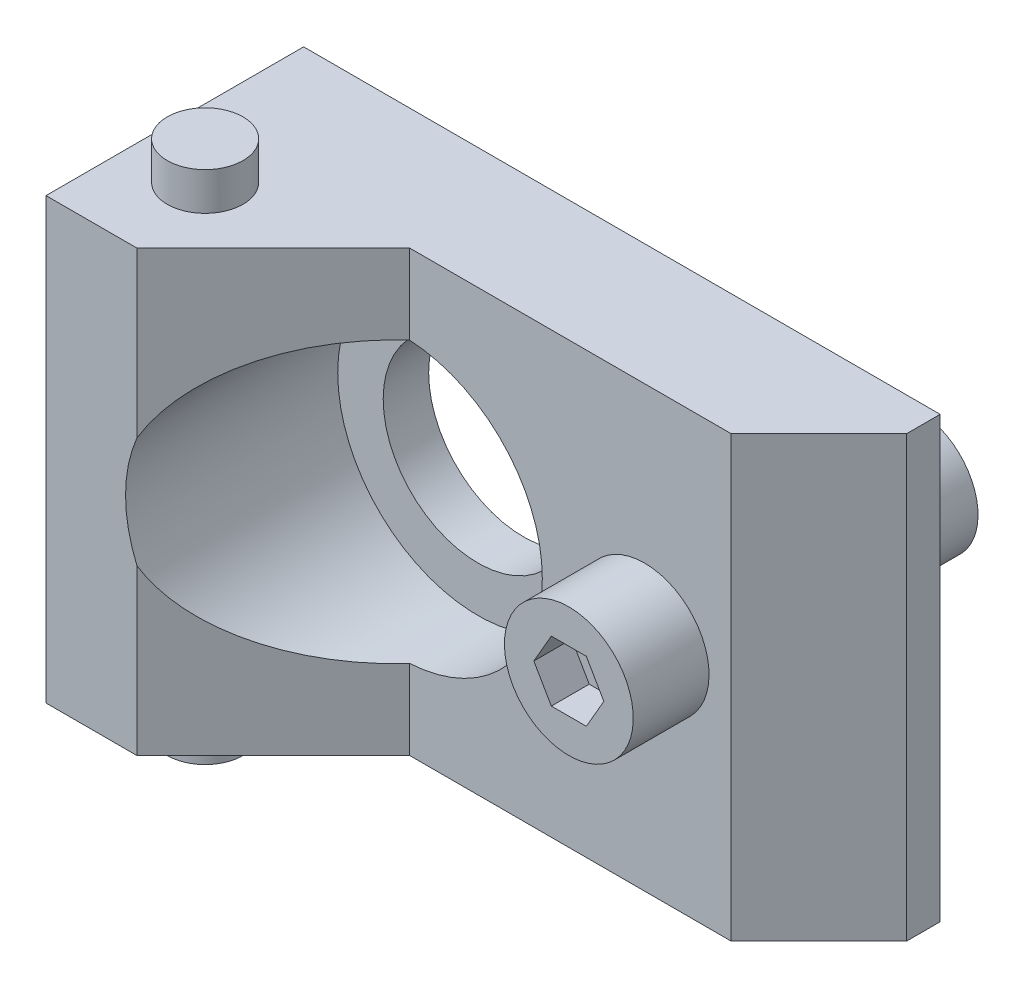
ISO-10303-21;
HEADER;
FILE_DESCRIPTION(('STEP AP214'),'2;1');
FILE_NAME('part.step','',(''),(''),'','','');
FILE_SCHEMA(('AUTOMOTIVE_DESIGN { 1 0 10303 214 1 1 1 1 }'));
ENDSEC;
DATA;
#1=APPLICATION_CONTEXT('core data for automotive mechanical design processes');
#2=APPLICATION_PROTOCOL_DEFINITION('international standard','automotive_design',2000,#1);
#3=PRODUCT_CONTEXT('',#1,'mechanical');
#4=PRODUCT('Part','Part','',(#3));
#5=PRODUCT_RELATED_PRODUCT_CATEGORY('part','',(#4));
#6=PRODUCT_DEFINITION_FORMATION('','',#4);
#7=PRODUCT_DEFINITION_CONTEXT('part definition',#1,'design');
#8=PRODUCT_DEFINITION('design','',#6,#7);
#9=PRODUCT_DEFINITION_SHAPE('','',#8);
#10=(LENGTH_UNIT() NAMED_UNIT(*) SI_UNIT(.MILLI.,.METRE.));
#11=(NAMED_UNIT(*) PLANE_ANGLE_UNIT() SI_UNIT($,.RADIAN.));
#12=(NAMED_UNIT(*) SI_UNIT($,.STERADIAN.) SOLID_ANGLE_UNIT());
#13=UNCERTAINTY_MEASURE_WITH_UNIT(LENGTH_MEASURE(1.E-05),#10,'distance_accuracy_value','');
#14=(GEOMETRIC_REPRESENTATION_CONTEXT(3) GLOBAL_UNCERTAINTY_ASSIGNED_CONTEXT((#13)) GLOBAL_UNIT_ASSIGNED_CONTEXT((#10,
#11,#12)) REPRESENTATION_CONTEXT('',''));
#15=CARTESIAN_POINT('',(0.,0.,0.));
#16=DIRECTION('',(0.,0.,1.));
#17=DIRECTION('',(1.,0.,0.));
#18=AXIS2_PLACEMENT_3D('',#15,#16,#17);
#19=CARTESIAN_POINT('',(-26.,-17.,11.));
#20=DIRECTION('',(0.,1.,0.));
#21=DIRECTION('',(1.,0.,0.));
#22=AXIS2_PLACEMENT_3D('',#19,#20,#21);
#23=CYLINDRICAL_SURFACE('',#22,2.5);
#24=CARTESIAN_POINT('',(-26.,-17.,11.));
#25=DIRECTION('',(0.,-1.,0.));
#26=DIRECTION('',(-1.,0.,0.));
#27=AXIS2_PLACEMENT_3D('',#24,#25,#26);
#28=CIRCLE('',#27,2.5);
#29=CARTESIAN_POINT('',(-28.5,-17.,11.));
#30=VERTEX_POINT('',#29);
#31=EDGE_CURVE('E21',#30,#30,#28,.T.);
#32=ORIENTED_EDGE('',*,*,#31,.F.);
#33=EDGE_LOOP('',(#32));
#34=FACE_BOUND('',#33,.T.);
#35=CARTESIAN_POINT('',(-26.,-14.5,11.));
#36=DIRECTION('',(0.,1.,0.));
#37=DIRECTION('',(-1.,0.,0.));
#38=AXIS2_PLACEMENT_3D('',#35,#36,#37);
#39=CIRCLE('',#38,2.5);
#40=CARTESIAN_POINT('',(-28.5,-14.5,11.));
#41=VERTEX_POINT('',#40);
#42=EDGE_CURVE('E9',#41,#41,#39,.T.);
#43=ORIENTED_EDGE('',*,*,#42,.F.);
#44=EDGE_LOOP('',(#43));
#45=FACE_BOUND('',#44,.T.);
#46=ADVANCED_FACE('F14',(#34,#45),#23,.T.);
#47=CARTESIAN_POINT('',(-26.,-17.,11.));
#48=DIRECTION('',(0.,-1.,0.));
#49=DIRECTION('',(-1.,0.,0.));
#50=AXIS2_PLACEMENT_3D('',#47,#48,#49);
#51=PLANE('',#50);
#52=ORIENTED_EDGE('',*,*,#31,.T.);
#53=EDGE_LOOP('',(#52));
#54=FACE_BOUND('',#53,.T.);
#55=ADVANCED_FACE('F229',(#54),#51,.T.);
#56=CARTESIAN_POINT('',(-3.46410161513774,-2.,10.5));
#57=DIRECTION('',(0.,0.,-1.));
#58=DIRECTION('',(0.,-1.,0.));
#59=AXIS2_PLACEMENT_3D('',#56,#57,#58);
#60=PLANE('',#59);
#61=DIRECTION('',(0.5,0.86602540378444,0.));
#62=VECTOR('',#61,1.);
#63=CARTESIAN_POINT('',(-2.3094010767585,0.,10.5));
#64=LINE('',#63,#62);
#65=CARTESIAN_POINT('',(-2.3094010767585,0.,10.5));
#66=VERTEX_POINT('',#65);
#67=CARTESIAN_POINT('',(-1.15470053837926,2.,10.5));
#68=VERTEX_POINT('',#67);
#69=EDGE_CURVE('E174',#66,#68,#64,.T.);
#70=ORIENTED_EDGE('',*,*,#69,.F.);
#71=DIRECTION('',(0.5,-0.86602540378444,0.));
#72=VECTOR('',#71,1.);
#73=CARTESIAN_POINT('',(-2.3094010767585,0.,10.5));
#74=LINE('',#73,#72);
#75=CARTESIAN_POINT('',(-1.15470053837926,-2.,10.5));
#76=VERTEX_POINT('',#75);
#77=EDGE_CURVE('E188',#66,#76,#74,.T.);
#78=ORIENTED_EDGE('',*,*,#77,.T.);
#79=DIRECTION('',(1.,0.,0.));
#80=VECTOR('',#79,1.);
#81=CARTESIAN_POINT('',(-1.15470053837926,-2.,10.5));
#82=LINE('',#81,#80);
#83=CARTESIAN_POINT('',(1.15470053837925,-2.,10.5));
#84=VERTEX_POINT('',#83);
#85=EDGE_CURVE('E191',#76,#84,#82,.T.);
#86=ORIENTED_EDGE('',*,*,#85,.T.);
#87=DIRECTION('',(-0.5,-0.86602540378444,0.));
#88=VECTOR('',#87,1.);
#89=CARTESIAN_POINT('',(2.3094010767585,0.,10.5));
#90=LINE('',#89,#88);
#91=CARTESIAN_POINT('',(2.3094010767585,0.,10.5));
#92=VERTEX_POINT('',#91);
#93=EDGE_CURVE('E194',#92,#84,#90,.T.);
#94=ORIENTED_EDGE('',*,*,#93,.F.);
#95=DIRECTION('',(-0.5,0.86602540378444,0.));
#96=VECTOR('',#95,1.);
#97=CARTESIAN_POINT('',(2.3094010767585,0.,10.5));
#98=LINE('',#97,#96);
#99=CARTESIAN_POINT('',(1.15470053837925,2.,10.5));
#100=VERTEX_POINT('',#99);
#101=EDGE_CURVE('E197',#92,#100,#98,.T.);
#102=ORIENTED_EDGE('',*,*,#101,.T.);
#103=DIRECTION('',(-1.,0.,0.));
#104=VECTOR('',#103,1.);
#105=CARTESIAN_POINT('',(1.15470053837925,2.,10.5));
#106=LINE('',#105,#104);
#107=EDGE_CURVE('E200',#100,#68,#106,.T.);
#108=ORIENTED_EDGE('',*,*,#107,.T.);
#109=EDGE_LOOP('',(#70,#78,#86,#94,#102,#108));
#110=FACE_BOUND('',#109,.T.);
#111=ADVANCED_FACE('F251',(#110),#60,.F.);
#112=CARTESIAN_POINT('',(-26.,17.,11.));
#113=DIRECTION('',(0.,1.,0.));
#114=DIRECTION('',(-1.,0.,0.));
#115=AXIS2_PLACEMENT_3D('',#112,#113,#114);
#116=PLANE('',#115);
#117=CARTESIAN_POINT('',(-26.,17.,11.));
#118=DIRECTION('',(0.,1.,0.));
#119=DIRECTION('',(-1.,0.,0.));
#120=AXIS2_PLACEMENT_3D('',#117,#118,#119);
#121=CIRCLE('',#120,2.5);
#122=CARTESIAN_POINT('',(-28.5,17.,11.));
#123=VERTEX_POINT('',#122);
#124=EDGE_CURVE('E221',#123,#123,#121,.T.);
#125=ORIENTED_EDGE('',*,*,#124,.T.);
#126=EDGE_LOOP('',(#125));
#127=FACE_BOUND('',#126,.T.);
#128=ADVANCED_FACE('F253',(#127),#116,.T.);
#129=CARTESIAN_POINT('',(-1.15470053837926,-2.,10.5));
#130=DIRECTION('',(0.,-1.,0.));
#131=DIRECTION('',(1.,0.,0.));
#132=AXIS2_PLACEMENT_3D('',#129,#130,#131);
#133=PLANE('',#132);
#134=DIRECTION('',(0.,0.,1.));
#135=VECTOR('',#134,1.);
#136=CARTESIAN_POINT('',(-1.15470053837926,-2.,10.5));
#137=LINE('',#136,#135);
#138=CARTESIAN_POINT('',(-1.15470053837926,-2.,13.));
#139=VERTEX_POINT('',#138);
#140=EDGE_CURVE('E205',#76,#139,#137,.T.);
#141=ORIENTED_EDGE('',*,*,#140,.T.);
#142=DIRECTION('',(1.,0.,0.));
#143=VECTOR('',#142,1.);
#144=CARTESIAN_POINT('',(-1.15470053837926,-2.,13.));
#145=LINE('',#144,#143);
#146=CARTESIAN_POINT('',(1.15470053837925,-2.,13.));
#147=VERTEX_POINT('',#146);
#148=EDGE_CURVE('E175',#139,#147,#145,.T.);
#149=ORIENTED_EDGE('',*,*,#148,.T.);
#150=DIRECTION('',(0.,0.,1.));
#151=VECTOR('',#150,1.);
#152=CARTESIAN_POINT('',(1.15470053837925,-2.,10.5));
#153=LINE('',#152,#151);
#154=EDGE_CURVE('E207',#84,#147,#153,.T.);
#155=ORIENTED_EDGE('',*,*,#154,.F.);
#156=ORIENTED_EDGE('',*,*,#85,.F.);
#157=EDGE_LOOP('',(#141,#149,#155,#156));
#158=FACE_BOUND('',#157,.T.);
#159=ADVANCED_FACE('F261',(#158),#133,.F.);
#160=CARTESIAN_POINT('',(2.3094010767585,0.,10.5));
#161=DIRECTION('',(-0.86602540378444,0.5,0.));
#162=DIRECTION('',(-0.5,-0.86602540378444,0.));
#163=AXIS2_PLACEMENT_3D('',#160,#161,#162);
#164=PLANE('',#163);
#165=ORIENTED_EDGE('',*,*,#154,.T.);
#166=DIRECTION('',(-0.5,-0.86602540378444,0.));
#167=VECTOR('',#166,1.);
#168=CARTESIAN_POINT('',(2.3094010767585,0.,13.));
#169=LINE('',#168,#167);
#170=CARTESIAN_POINT('',(2.3094010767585,0.,13.));
#171=VERTEX_POINT('',#170);
#172=EDGE_CURVE('E178',#171,#147,#169,.T.);
#173=ORIENTED_EDGE('',*,*,#172,.F.);
#174=DIRECTION('',(0.,0.,1.));
#175=VECTOR('',#174,1.);
#176=CARTESIAN_POINT('',(2.3094010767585,0.,10.5));
#177=LINE('',#176,#175);
#178=EDGE_CURVE('E209',#92,#171,#177,.T.);
#179=ORIENTED_EDGE('',*,*,#178,.F.);
#180=ORIENTED_EDGE('',*,*,#93,.T.);
#181=EDGE_LOOP('',(#165,#173,#179,#180));
#182=FACE_BOUND('',#181,.T.);
#183=ADVANCED_FACE('F279',(#182),#164,.T.);
#184=CARTESIAN_POINT('',(2.3094010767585,0.,10.5));
#185=DIRECTION('',(0.86602540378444,0.5,0.));
#186=DIRECTION('',(-0.5,0.86602540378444,0.));
#187=AXIS2_PLACEMENT_3D('',#184,#185,#186);
#188=PLANE('',#187);
#189=ORIENTED_EDGE('',*,*,#178,.T.);
#190=DIRECTION('',(-0.5,0.86602540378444,0.));
#191=VECTOR('',#190,1.);
#192=CARTESIAN_POINT('',(2.3094010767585,0.,13.));
#193=LINE('',#192,#191);
#194=CARTESIAN_POINT('',(1.15470053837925,2.,13.));
#195=VERTEX_POINT('',#194);
#196=EDGE_CURVE('E181',#171,#195,#193,.T.);
#197=ORIENTED_EDGE('',*,*,#196,.T.);
#198=DIRECTION('',(0.,0.,1.));
#199=VECTOR('',#198,1.);
#200=CARTESIAN_POINT('',(1.15470053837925,2.,10.5));
#201=LINE('',#200,#199);
#202=EDGE_CURVE('E211',#100,#195,#201,.T.);
#203=ORIENTED_EDGE('',*,*,#202,.F.);
#204=ORIENTED_EDGE('',*,*,#101,.F.);
#205=EDGE_LOOP('',(#189,#197,#203,#204));
#206=FACE_BOUND('',#205,.T.);
#207=ADVANCED_FACE('F283',(#206),#188,.F.);
#208=CARTESIAN_POINT('',(1.15470053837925,2.,10.5));
#209=DIRECTION('',(0.,1.,0.));
#210=DIRECTION('',(0.,0.,-1.));
#211=AXIS2_PLACEMENT_3D('',#208,#209,#210);
#212=PLANE('',#211);
#213=ORIENTED_EDGE('',*,*,#202,.T.);
#214=DIRECTION('',(-1.,0.,0.));
#215=VECTOR('',#214,1.);
#216=CARTESIAN_POINT('',(1.15470053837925,2.,13.));
#217=LINE('',#216,#215);
#218=CARTESIAN_POINT('',(-1.15470053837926,2.,13.));
#219=VERTEX_POINT('',#218);
#220=EDGE_CURVE('E184',#195,#219,#217,.T.);
#221=ORIENTED_EDGE('',*,*,#220,.T.);
#222=DIRECTION('',(0.,0.,1.));
#223=VECTOR('',#222,1.);
#224=CARTESIAN_POINT('',(-1.15470053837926,2.,10.5));
#225=LINE('',#224,#223);
#226=EDGE_CURVE('E213',#68,#219,#225,.T.);
#227=ORIENTED_EDGE('',*,*,#226,.F.);
#228=ORIENTED_EDGE('',*,*,#107,.F.);
#229=EDGE_LOOP('',(#213,#221,#227,#228));
#230=FACE_BOUND('',#229,.T.);
#231=ADVANCED_FACE('F272',(#230),#212,.F.);
#232=CARTESIAN_POINT('',(-2.3094010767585,0.,10.5));
#233=DIRECTION('',(0.86602540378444,-0.5,0.));
#234=DIRECTION('',(0.5,0.86602540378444,0.));
#235=AXIS2_PLACEMENT_3D('',#232,#233,#234);
#236=PLANE('',#235);
#237=ORIENTED_EDGE('',*,*,#226,.T.);
#238=DIRECTION('',(0.5,0.86602540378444,0.));
#239=VECTOR('',#238,1.);
#240=CARTESIAN_POINT('',(-2.3094010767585,0.,13.));
#241=LINE('',#240,#239);
#242=CARTESIAN_POINT('',(-2.3094010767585,0.,13.));
#243=VERTEX_POINT('',#242);
#244=EDGE_CURVE('E28',#243,#219,#241,.T.);
#245=ORIENTED_EDGE('',*,*,#244,.F.);
#246=DIRECTION('',(0.,0.,1.));
#247=VECTOR('',#246,1.);
#248=CARTESIAN_POINT('',(-2.3094010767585,0.,10.5));
#249=LINE('',#248,#247);
#250=EDGE_CURVE('E32',#66,#243,#249,.T.);
#251=ORIENTED_EDGE('',*,*,#250,.F.);
#252=ORIENTED_EDGE('',*,*,#69,.T.);
#253=EDGE_LOOP('',(#237,#245,#251,#252));
#254=FACE_BOUND('',#253,.T.);
#255=ADVANCED_FACE('F268',(#254),#236,.T.);
#256=CARTESIAN_POINT('',(-2.3094010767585,0.,10.5));
#257=DIRECTION('',(-0.86602540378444,-0.5,0.));
#258=DIRECTION('',(0.5,-0.86602540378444,0.));
#259=AXIS2_PLACEMENT_3D('',#256,#257,#258);
#260=PLANE('',#259);
#261=ORIENTED_EDGE('',*,*,#77,.F.);
#262=ORIENTED_EDGE('',*,*,#250,.T.);
#263=DIRECTION('',(0.5,-0.86602540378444,0.));
#264=VECTOR('',#263,1.);
#265=CARTESIAN_POINT('',(-2.3094010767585,0.,13.));
#266=LINE('',#265,#264);
#267=EDGE_CURVE('E171',#243,#139,#266,.T.);
#268=ORIENTED_EDGE('',*,*,#267,.T.);
#269=ORIENTED_EDGE('',*,*,#140,.F.);
#270=EDGE_LOOP('',(#261,#262,#268,#269));
#271=FACE_BOUND('',#270,.T.);
#272=ADVANCED_FACE('F271',(#271),#260,.F.);
#273=CARTESIAN_POINT('',(0.,0.,-10.));
#274=DIRECTION('',(0.,0.,-1.));
#275=DIRECTION('',(0.898965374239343,0.438019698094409,0.));
#276=AXIS2_PLACEMENT_3D('',#273,#274,#275);
#277=PLANE('',#276);
#278=CARTESIAN_POINT('',(0.,0.,-10.));
#279=DIRECTION('',(0.,0.,-1.));
#280=DIRECTION('',(0.898965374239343,0.438019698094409,0.));
#281=AXIS2_PLACEMENT_3D('',#278,#279,#280);
#282=CIRCLE('',#281,4.);
#283=CARTESIAN_POINT('',(3.59586149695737,1.75207879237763,-10.));
#284=VERTEX_POINT('',#283);
#285=EDGE_CURVE('E165',#284,#284,#282,.T.);
#286=ORIENTED_EDGE('',*,*,#285,.T.);
#287=EDGE_LOOP('',(#286));
#288=FACE_BOUND('',#287,.T.);
#289=ADVANCED_FACE('F275',(#288),#277,.T.);
#290=CARTESIAN_POINT('',(-16.,0.,3.));
#291=DIRECTION('',(0.,0.,1.));
#292=DIRECTION('',(-1.,0.,0.));
#293=AXIS2_PLACEMENT_3D('',#290,#291,#292);
#294=PLANE('',#293);
#295=CARTESIAN_POINT('',(-16.,0.,3.));
#296=DIRECTION('',(0.,0.,1.));
#297=DIRECTION('',(-1.,0.,0.));
#298=AXIS2_PLACEMENT_3D('',#295,#296,#297);
#299=CIRCLE('',#298,9.25);
#300=CARTESIAN_POINT('',(-25.25,0.,3.));
#301=VERTEX_POINT('',#300);
#302=EDGE_CURVE('E160',#301,#301,#299,.T.);
#303=ORIENTED_EDGE('',*,*,#302,.T.);
#304=EDGE_LOOP('',(#303));
#305=FACE_BOUND('',#304,.T.);
#306=CARTESIAN_POINT('',(-16.,0.,3.));
#307=DIRECTION('',(0.,0.,1.));
#308=DIRECTION('',(-1.,0.,0.));
#309=AXIS2_PLACEMENT_3D('',#306,#307,#308);
#310=CIRCLE('',#309,6.25);
#311=CARTESIAN_POINT('',(-22.25,0.,3.));
#312=VERTEX_POINT('',#311);
#313=EDGE_CURVE('E157',#312,#312,#310,.F.);
#314=ORIENTED_EDGE('',*,*,#313,.T.);
#315=EDGE_LOOP('',(#314));
#316=FACE_BOUND('',#315,.T.);
#317=ADVANCED_FACE('F301',(#305,#316),#294,.T.);
#318=CARTESIAN_POINT('',(-26.,17.,11.));
#319=DIRECTION('',(0.,-1.,0.));
#320=DIRECTION('',(1.,0.,0.));
#321=AXIS2_PLACEMENT_3D('',#318,#319,#320);
#322=CYLINDRICAL_SURFACE('',#321,2.5);
#323=ORIENTED_EDGE('',*,*,#124,.F.);
#324=EDGE_LOOP('',(#323));
#325=FACE_BOUND('',#324,.T.);
#326=CARTESIAN_POINT('',(-26.,14.5,11.));
#327=DIRECTION('',(0.,-1.,0.));
#328=DIRECTION('',(0.,0.,-1.));
#329=AXIS2_PLACEMENT_3D('',#326,#327,#328);
#330=CIRCLE('',#329,2.5);
#331=CARTESIAN_POINT('',(-26.,14.5,8.5));
#332=VERTEX_POINT('',#331);
#333=EDGE_CURVE('E224',#332,#332,#330,.T.);
#334=ORIENTED_EDGE('',*,*,#333,.F.);
#335=EDGE_LOOP('',(#334));
#336=FACE_BOUND('',#335,.T.);
#337=ADVANCED_FACE('F297',(#325,#336),#322,.T.);
#338=CARTESIAN_POINT('',(0.,0.,13.));
#339=DIRECTION('',(0.,0.,1.));
#340=DIRECTION('',(0.,1.,0.));
#341=AXIS2_PLACEMENT_3D('',#338,#339,#340);
#342=PLANE('',#341);
#343=CARTESIAN_POINT('',(0.,0.,13.));
#344=DIRECTION('',(0.,0.,1.));
#345=DIRECTION('',(0.,1.,0.));
#346=AXIS2_PLACEMENT_3D('',#343,#344,#345);
#347=CIRCLE('',#346,4.25);
#348=CARTESIAN_POINT('',(0.,4.25,13.));
#349=VERTEX_POINT('',#348);
#350=EDGE_CURVE('E218',#349,#349,#347,.T.);
#351=ORIENTED_EDGE('',*,*,#350,.T.);
#352=EDGE_LOOP('',(#351));
#353=FACE_BOUND('',#352,.T.);
#354=ORIENTED_EDGE('',*,*,#267,.F.);
#355=ORIENTED_EDGE('',*,*,#244,.T.);
#356=ORIENTED_EDGE('',*,*,#220,.F.);
#357=ORIENTED_EDGE('',*,*,#196,.F.);
#358=ORIENTED_EDGE('',*,*,#172,.T.);
#359=ORIENTED_EDGE('',*,*,#148,.F.);
#360=EDGE_LOOP('',(#354,#355,#356,#357,#358,#359));
#361=FACE_BOUND('',#360,.T.);
#362=ADVANCED_FACE('F295',(#353,#361),#342,.T.);
#363=CARTESIAN_POINT('',(0.,0.,-10.));
#364=DIRECTION('',(0.,0.,1.));
#365=DIRECTION('',(-0.898965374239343,-0.438019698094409,0.));
#366=AXIS2_PLACEMENT_3D('',#363,#364,#365);
#367=CYLINDRICAL_SURFACE('',#366,4.);
#368=ORIENTED_EDGE('',*,*,#285,.F.);
#369=EDGE_LOOP('',(#368));
#370=FACE_BOUND('',#369,.T.);
#371=CARTESIAN_POINT('',(0.,0.,0.));
#372=DIRECTION('',(0.,0.,1.));
#373=DIRECTION('',(0.,-1.,0.));
#374=AXIS2_PLACEMENT_3D('',#371,#372,#373);
#375=CIRCLE('',#374,4.);
#376=CARTESIAN_POINT('',(0.,-4.,0.));
#377=VERTEX_POINT('',#376);
#378=EDGE_CURVE('E168',#377,#377,#375,.T.);
#379=ORIENTED_EDGE('',*,*,#378,.F.);
#380=EDGE_LOOP('',(#379));
#381=FACE_BOUND('',#380,.T.);
#382=ADVANCED_FACE('F266',(#370,#381),#367,.T.);
#383=CARTESIAN_POINT('',(-16.,0.,17.));
#384=DIRECTION('',(0.,0.,1.));
#385=DIRECTION('',(-1.,0.,0.));
#386=AXIS2_PLACEMENT_3D('',#383,#384,#385);
#387=CYLINDRICAL_SURFACE('',#386,6.25);
#388=CARTESIAN_POINT('',(-16.,0.,0.));
#389=DIRECTION('',(0.,0.,1.));
#390=DIRECTION('',(-1.,0.,0.));
#391=AXIS2_PLACEMENT_3D('',#388,#389,#390);
#392=CIRCLE('',#391,6.25);
#393=CARTESIAN_POINT('',(-22.25,0.,0.));
#394=VERTEX_POINT('',#393);
#395=EDGE_CURVE('E159',#394,#394,#392,.T.);
#396=ORIENTED_EDGE('',*,*,#395,.F.);
#397=EDGE_LOOP('',(#396));
#398=FACE_BOUND('',#397,.T.);
#399=ORIENTED_EDGE('',*,*,#313,.F.);
#400=EDGE_LOOP('',(#399));
#401=FACE_BOUND('',#400,.T.);
#402=ADVANCED_FACE('F335',(#398,#401),#387,.F.);
#403=CARTESIAN_POINT('',(-16.,0.,3.));
#404=DIRECTION('',(0.,0.,1.));
#405=DIRECTION('',(-1.,0.,0.));
#406=AXIS2_PLACEMENT_3D('',#403,#404,#405);
#407=CYLINDRICAL_SURFACE('',#406,9.25);
#408=CARTESIAN_POINT('',(-16.,0.,17.));
#409=DIRECTION('',(0.,0.,1.));
#410=DIRECTION('',(-1.,0.,0.));
#411=AXIS2_PLACEMENT_3D('',#408,#409,#410);
#412=CIRCLE('',#411,9.25);
#413=CARTESIAN_POINT('',(-24.5,3.64862987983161,17.));
#414=VERTEX_POINT('',#413);
#415=CARTESIAN_POINT('',(-24.5,-3.6486298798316,17.));
#416=VERTEX_POINT('',#415);
#417=EDGE_CURVE('E364',#414,#416,#412,.T.);
#418=ORIENTED_EDGE('',*,*,#417,.T.);
#419=CARTESIAN_POINT('',(-16.,0.,8.5));
#420=DIRECTION('',(-0.707106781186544,0.,-0.707106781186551));
#421=DIRECTION('',(-0.707106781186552,0.,0.707106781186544));
#422=AXIS2_PLACEMENT_3D('',#419,#420,#421);
#423=ELLIPSE('',#422,13.0814754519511,9.25);
#424=CARTESIAN_POINT('',(-15.5,-9.23647660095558,8.));
#425=VERTEX_POINT('',#424);
#426=EDGE_CURVE('E164',#416,#425,#423,.F.);
#427=ORIENTED_EDGE('',*,*,#426,.T.);
#428=CARTESIAN_POINT('',(-16.,0.,8.));
#429=DIRECTION('',(0.,0.,-1.));
#430=DIRECTION('',(1.,0.,0.));
#431=AXIS2_PLACEMENT_3D('',#428,#429,#430);
#432=CIRCLE('',#431,9.25);
#433=CARTESIAN_POINT('',(-15.5,9.23647660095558,8.));
#434=VERTEX_POINT('',#433);
#435=EDGE_CURVE('E146',#425,#434,#432,.F.);
#436=ORIENTED_EDGE('',*,*,#435,.T.);
#437=EDGE_CURVE('E150',#434,#414,#423,.F.);
#438=ORIENTED_EDGE('',*,*,#437,.T.);
#439=EDGE_LOOP('',(#418,#427,#436,#438));
#440=FACE_BOUND('',#439,.T.);
#441=ORIENTED_EDGE('',*,*,#302,.F.);
#442=EDGE_LOOP('',(#441));
#443=FACE_BOUND('',#442,.T.);
#444=ADVANCED_FACE('F319',(#440,#443),#407,.F.);
#445=CARTESIAN_POINT('',(-24.5,-14.5,17.));
#446=DIRECTION('',(-0.707106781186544,0.,-0.707106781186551));
#447=DIRECTION('',(0.707106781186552,0.,-0.707106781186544));
#448=AXIS2_PLACEMENT_3D('',#445,#446,#447);
#449=PLANE('',#448);
#450=DIRECTION('',(0.,1.,0.));
#451=VECTOR('',#450,1.);
#452=CARTESIAN_POINT('',(-15.5,-14.5,8.));
#453=LINE('',#452,#451);
#454=CARTESIAN_POINT('',(-15.5,14.5,8.));
#455=VERTEX_POINT('',#454);
#456=EDGE_CURVE('E404',#434,#455,#453,.T.);
#457=ORIENTED_EDGE('',*,*,#456,.T.);
#458=DIRECTION('',(-0.707106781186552,0.,0.707106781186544));
#459=VECTOR('',#458,1.);
#460=CARTESIAN_POINT('',(-24.5,14.5,17.));
#461=LINE('',#460,#459);
#462=CARTESIAN_POINT('',(-24.5,14.5,17.));
#463=VERTEX_POINT('',#462);
#464=EDGE_CURVE('E369',#455,#463,#461,.T.);
#465=ORIENTED_EDGE('',*,*,#464,.T.);
#466=DIRECTION('',(0.,1.,0.));
#467=VECTOR('',#466,1.);
#468=CARTESIAN_POINT('',(-24.5,-14.5,17.));
#469=LINE('',#468,#467);
#470=EDGE_CURVE('E359',#414,#463,#469,.T.);
#471=ORIENTED_EDGE('',*,*,#470,.F.);
#472=ORIENTED_EDGE('',*,*,#437,.F.);
#473=EDGE_LOOP('',(#457,#465,#471,#472));
#474=FACE_BOUND('',#473,.T.);
#475=ADVANCED_FACE('F313',(#474),#449,.F.);
#476=CARTESIAN_POINT('',(11.5,14.5,17.));
#477=DIRECTION('',(0.,-1.,0.));
#478=DIRECTION('',(1.,0.,0.));
#479=AXIS2_PLACEMENT_3D('',#476,#477,#478);
#480=PLANE('',#479);
#481=DIRECTION('',(-1.,0.,0.));
#482=VECTOR('',#481,1.);
#483=CARTESIAN_POINT('',(11.5,14.5,17.));
#484=LINE('',#483,#482);
#485=CARTESIAN_POINT('',(-30.5,14.5,17.));
#486=VERTEX_POINT('',#485);
#487=EDGE_CURVE('E360',#463,#486,#484,.T.);
#488=ORIENTED_EDGE('',*,*,#487,.F.);
#489=ORIENTED_EDGE('',*,*,#464,.F.);
#490=DIRECTION('',(-1.,0.,0.));
#491=VECTOR('',#490,1.);
#492=CARTESIAN_POINT('',(5.71320343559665,14.5,8.));
#493=LINE('',#492,#491);
#494=CARTESIAN_POINT('',(5.71320343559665,14.5,8.));
#495=VERTEX_POINT('',#494);
#496=EDGE_CURVE('E140',#495,#455,#493,.T.);
#497=ORIENTED_EDGE('',*,*,#496,.F.);
#498=DIRECTION('',(-0.707106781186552,0.,0.707106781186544));
#499=VECTOR('',#498,1.);
#500=CARTESIAN_POINT('',(5.71320343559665,14.5,8.));
#501=LINE('',#500,#499);
#502=CARTESIAN_POINT('',(11.5,14.5,2.2132034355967));
#503=VERTEX_POINT('',#502);
#504=EDGE_CURVE('E122',#503,#495,#501,.T.);
#505=ORIENTED_EDGE('',*,*,#504,.F.);
#506=DIRECTION('',(0.,0.,-1.));
#507=VECTOR('',#506,1.);
#508=CARTESIAN_POINT('',(11.5,14.5,17.));
#509=LINE('',#508,#507);
#510=CARTESIAN_POINT('',(11.5,14.5,0.));
#511=VERTEX_POINT('',#510);
#512=EDGE_CURVE('E136',#503,#511,#509,.T.);
#513=ORIENTED_EDGE('',*,*,#512,.T.);
#514=DIRECTION('',(-1.,0.,0.));
#515=VECTOR('',#514,1.);
#516=CARTESIAN_POINT('',(11.5,14.5,0.));
#517=LINE('',#516,#515);
#518=CARTESIAN_POINT('',(-30.5,14.5,0.));
#519=VERTEX_POINT('',#518);
#520=EDGE_CURVE('E390',#511,#519,#517,.T.);
#521=ORIENTED_EDGE('',*,*,#520,.T.);
#522=DIRECTION('',(0.,0.,-1.));
#523=VECTOR('',#522,1.);
#524=CARTESIAN_POINT('',(-30.5,14.5,17.));
#525=LINE('',#524,#523);
#526=EDGE_CURVE('E147',#486,#519,#525,.T.);
#527=ORIENTED_EDGE('',*,*,#526,.F.);
#528=EDGE_LOOP('',(#488,#489,#497,#505,#513,#521,#527));
#529=FACE_BOUND('',#528,.T.);
#530=ORIENTED_EDGE('',*,*,#333,.T.);
#531=EDGE_LOOP('',(#530));
#532=FACE_BOUND('',#531,.T.);
#533=ADVANCED_FACE('F134',(#529,#532),#480,.F.);
#534=CARTESIAN_POINT('',(0.,0.,18.));
#535=DIRECTION('',(0.,0.,1.));
#536=DIRECTION('',(0.,1.,0.));
#537=AXIS2_PLACEMENT_3D('',#534,#535,#536);
#538=CYLINDRICAL_SURFACE('',#537,4.25);
#539=CARTESIAN_POINT('',(0.,0.,8.));
#540=DIRECTION('',(0.,0.,1.));
#541=DIRECTION('',(0.,1.,0.));
#542=AXIS2_PLACEMENT_3D('',#539,#540,#541);
#543=CIRCLE('',#542,4.25);
#544=CARTESIAN_POINT('',(0.,4.25,8.));
#545=VERTEX_POINT('',#544);
#546=EDGE_CURVE('E215',#545,#545,#543,.T.);
#547=ORIENTED_EDGE('',*,*,#546,.T.);
#548=EDGE_LOOP('',(#547));
#549=FACE_BOUND('',#548,.T.);
#550=ORIENTED_EDGE('',*,*,#350,.F.);
#551=EDGE_LOOP('',(#550));
#552=FACE_BOUND('',#551,.T.);
#553=ADVANCED_FACE('F291',(#549,#552),#538,.T.);
#554=CARTESIAN_POINT('',(5.71320343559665,-14.5,8.));
#555=DIRECTION('',(-0.707106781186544,0.,-0.707106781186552));
#556=DIRECTION('',(0.707106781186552,0.,-0.707106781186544));
#557=AXIS2_PLACEMENT_3D('',#554,#555,#556);
#558=PLANE('',#557);
#559=ORIENTED_EDGE('',*,*,#504,.T.);
#560=DIRECTION('',(0.,1.,0.));
#561=VECTOR('',#560,1.);
#562=CARTESIAN_POINT('',(5.71320343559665,-14.5,8.));
#563=LINE('',#562,#561);
#564=CARTESIAN_POINT('',(5.71320343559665,-14.5,8.));
#565=VERTEX_POINT('',#564);
#566=EDGE_CURVE('E129',#565,#495,#563,.T.);
#567=ORIENTED_EDGE('',*,*,#566,.F.);
#568=DIRECTION('',(-0.707106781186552,0.,0.707106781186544));
#569=VECTOR('',#568,1.);
#570=CARTESIAN_POINT('',(5.71320343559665,-14.5,8.));
#571=LINE('',#570,#569);
#572=CARTESIAN_POINT('',(11.5,-14.5,2.2132034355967));
#573=VERTEX_POINT('',#572);
#574=EDGE_CURVE('E125',#573,#565,#571,.T.);
#575=ORIENTED_EDGE('',*,*,#574,.F.);
#576=DIRECTION('',(0.,1.,0.));
#577=VECTOR('',#576,1.);
#578=CARTESIAN_POINT('',(11.5,-14.5,2.2132034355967));
#579=LINE('',#578,#577);
#580=EDGE_CURVE('E119',#573,#503,#579,.T.);
#581=ORIENTED_EDGE('',*,*,#580,.T.);
#582=EDGE_LOOP('',(#559,#567,#575,#581));
#583=FACE_BOUND('',#582,.T.);
#584=ADVANCED_FACE('F121',(#583),#558,.F.);
#585=CARTESIAN_POINT('',(11.5,-14.5,17.));
#586=DIRECTION('',(-1.,0.,0.));
#587=DIRECTION('',(0.,0.,-1.));
#588=AXIS2_PLACEMENT_3D('',#585,#586,#587);
#589=PLANE('',#588);
#590=ORIENTED_EDGE('',*,*,#512,.F.);
#591=ORIENTED_EDGE('',*,*,#580,.F.);
#592=DIRECTION('',(0.,0.,-1.));
#593=VECTOR('',#592,1.);
#594=CARTESIAN_POINT('',(11.5,-14.5,17.));
#595=LINE('',#594,#593);
#596=CARTESIAN_POINT('',(11.5,-14.5,0.));
#597=VERTEX_POINT('',#596);
#598=EDGE_CURVE('E383',#573,#597,#595,.T.);
#599=ORIENTED_EDGE('',*,*,#598,.T.);
#600=DIRECTION('',(0.,1.,0.));
#601=VECTOR('',#600,1.);
#602=CARTESIAN_POINT('',(11.5,-14.5,0.));
#603=LINE('',#602,#601);
#604=EDGE_CURVE('E145',#597,#511,#603,.T.);
#605=ORIENTED_EDGE('',*,*,#604,.T.);
#606=EDGE_LOOP('',(#590,#591,#599,#605));
#607=FACE_BOUND('',#606,.T.);
#608=ADVANCED_FACE('F143',(#607),#589,.F.);
#609=CARTESIAN_POINT('',(11.5,14.5,0.));
#610=DIRECTION('',(0.,0.,1.));
#611=DIRECTION('',(-1.,0.,0.));
#612=AXIS2_PLACEMENT_3D('',#609,#610,#611);
#613=PLANE('',#612);
#614=ORIENTED_EDGE('',*,*,#604,.F.);
#615=DIRECTION('',(1.,0.,0.));
#616=VECTOR('',#615,1.);
#617=CARTESIAN_POINT('',(11.5,-14.5,0.));
#618=LINE('',#617,#616);
#619=CARTESIAN_POINT('',(-30.5,-14.5,0.));
#620=VERTEX_POINT('',#619);
#621=EDGE_CURVE('E372',#620,#597,#618,.T.);
#622=ORIENTED_EDGE('',*,*,#621,.F.);
#623=DIRECTION('',(0.,-1.,0.));
#624=VECTOR('',#623,1.);
#625=CARTESIAN_POINT('',(-30.5,-14.5,0.));
#626=LINE('',#625,#624);
#627=EDGE_CURVE('E377',#519,#620,#626,.T.);
#628=ORIENTED_EDGE('',*,*,#627,.F.);
#629=ORIENTED_EDGE('',*,*,#520,.F.);
#630=EDGE_LOOP('',(#614,#622,#628,#629));
#631=FACE_BOUND('',#630,.T.);
#632=ORIENTED_EDGE('',*,*,#395,.T.);
#633=EDGE_LOOP('',(#632));
#634=FACE_BOUND('',#633,.T.);
#635=ORIENTED_EDGE('',*,*,#378,.T.);
#636=EDGE_LOOP('',(#635));
#637=FACE_BOUND('',#636,.T.);
#638=ADVANCED_FACE('F325',(#631,#634,#637),#613,.F.);
#639=CARTESIAN_POINT('',(-30.5,-14.5,17.));
#640=DIRECTION('',(1.,0.,0.));
#641=DIRECTION('',(0.,0.,1.));
#642=AXIS2_PLACEMENT_3D('',#639,#640,#641);
#643=PLANE('',#642);
#644=ORIENTED_EDGE('',*,*,#627,.T.);
#645=DIRECTION('',(0.,0.,-1.));
#646=VECTOR('',#645,1.);
#647=CARTESIAN_POINT('',(-30.5,-14.5,17.));
#648=LINE('',#647,#646);
#649=CARTESIAN_POINT('',(-30.5,-14.5,17.));
#650=VERTEX_POINT('',#649);
#651=EDGE_CURVE('E153',#650,#620,#648,.T.);
#652=ORIENTED_EDGE('',*,*,#651,.F.);
#653=DIRECTION('',(0.,-1.,0.));
#654=VECTOR('',#653,1.);
#655=CARTESIAN_POINT('',(-30.5,-14.5,17.));
#656=LINE('',#655,#654);
#657=EDGE_CURVE('E371',#486,#650,#656,.T.);
#658=ORIENTED_EDGE('',*,*,#657,.F.);
#659=ORIENTED_EDGE('',*,*,#526,.T.);
#660=EDGE_LOOP('',(#644,#652,#658,#659));
#661=FACE_BOUND('',#660,.T.);
#662=ADVANCED_FACE('F323',(#661),#643,.F.);
#663=CARTESIAN_POINT('',(11.5,14.5,17.));
#664=DIRECTION('',(0.,0.,1.));
#665=DIRECTION('',(-1.,0.,0.));
#666=AXIS2_PLACEMENT_3D('',#663,#664,#665);
#667=PLANE('',#666);
#668=ORIENTED_EDGE('',*,*,#470,.T.);
#669=ORIENTED_EDGE('',*,*,#487,.T.);
#670=ORIENTED_EDGE('',*,*,#657,.T.);
#671=DIRECTION('',(1.,0.,0.));
#672=VECTOR('',#671,1.);
#673=CARTESIAN_POINT('',(11.5,-14.5,17.));
#674=LINE('',#673,#672);
#675=CARTESIAN_POINT('',(-24.5,-14.5,17.));
#676=VERTEX_POINT('',#675);
#677=EDGE_CURVE('E374',#650,#676,#674,.T.);
#678=ORIENTED_EDGE('',*,*,#677,.T.);
#679=EDGE_CURVE('E366',#676,#416,#469,.T.);
#680=ORIENTED_EDGE('',*,*,#679,.T.);
#681=ORIENTED_EDGE('',*,*,#417,.F.);
#682=EDGE_LOOP('',(#668,#669,#670,#678,#680,#681));
#683=FACE_BOUND('',#682,.T.);
#684=ADVANCED_FACE('F345',(#683),#667,.T.);
#685=ORIENTED_EDGE('',*,*,#679,.F.);
#686=DIRECTION('',(-0.707106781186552,0.,0.707106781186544));
#687=VECTOR('',#686,1.);
#688=CARTESIAN_POINT('',(-24.5,-14.5,17.));
#689=LINE('',#688,#687);
#690=CARTESIAN_POINT('',(-15.5,-14.5,8.));
#691=VERTEX_POINT('',#690);
#692=EDGE_CURVE('E130',#691,#676,#689,.T.);
#693=ORIENTED_EDGE('',*,*,#692,.F.);
#694=EDGE_CURVE('E367',#691,#425,#453,.T.);
#695=ORIENTED_EDGE('',*,*,#694,.T.);
#696=ORIENTED_EDGE('',*,*,#426,.F.);
#697=EDGE_LOOP('',(#685,#693,#695,#696));
#698=FACE_BOUND('',#697,.T.);
#699=ADVANCED_FACE('F245',(#698),#449,.F.);
#700=CARTESIAN_POINT('',(5.71320343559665,-14.5,8.));
#701=DIRECTION('',(0.,0.,-1.));
#702=DIRECTION('',(1.,0.,0.));
#703=AXIS2_PLACEMENT_3D('',#700,#701,#702);
#704=PLANE('',#703);
#705=ORIENTED_EDGE('',*,*,#546,.F.);
#706=EDGE_LOOP('',(#705));
#707=FACE_BOUND('',#706,.T.);
#708=ORIENTED_EDGE('',*,*,#694,.F.);
#709=DIRECTION('',(-1.,0.,0.));
#710=VECTOR('',#709,1.);
#711=CARTESIAN_POINT('',(5.71320343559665,-14.5,8.));
#712=LINE('',#711,#710);
#713=EDGE_CURVE('E408',#565,#691,#712,.T.);
#714=ORIENTED_EDGE('',*,*,#713,.F.);
#715=ORIENTED_EDGE('',*,*,#566,.T.);
#716=ORIENTED_EDGE('',*,*,#496,.T.);
#717=ORIENTED_EDGE('',*,*,#456,.F.);
#718=ORIENTED_EDGE('',*,*,#435,.F.);
#719=EDGE_LOOP('',(#708,#714,#715,#716,#717,#718));
#720=FACE_BOUND('',#719,.T.);
#721=ADVANCED_FACE('F237',(#707,#720),#704,.F.);
#722=CARTESIAN_POINT('',(11.5,-14.5,17.));
#723=DIRECTION('',(0.,1.,0.));
#724=DIRECTION('',(-1.,0.,0.));
#725=AXIS2_PLACEMENT_3D('',#722,#723,#724);
#726=PLANE('',#725);
#727=ORIENTED_EDGE('',*,*,#713,.T.);
#728=ORIENTED_EDGE('',*,*,#692,.T.);
#729=ORIENTED_EDGE('',*,*,#677,.F.);
#730=ORIENTED_EDGE('',*,*,#651,.T.);
#731=ORIENTED_EDGE('',*,*,#621,.T.);
#732=ORIENTED_EDGE('',*,*,#598,.F.);
#733=ORIENTED_EDGE('',*,*,#574,.T.);
#734=EDGE_LOOP('',(#727,#728,#729,#730,#731,#732,#733));
#735=FACE_BOUND('',#734,.T.);
#736=ORIENTED_EDGE('',*,*,#42,.T.);
#737=EDGE_LOOP('',(#736));
#738=FACE_BOUND('',#737,.T.);
#739=ADVANCED_FACE('F233',(#735,#738),#726,.F.);
#740=CLOSED_SHELL('',(#46,#55,#111,#128,#159,#183,#207,#231,#255,#272,#289,#317,#337,#362,#382,
#402,#444,#475,#533,#553,#584,#608,#638,#662,#684,#699,#721,#739));
#741=MANIFOLD_SOLID_BREP('B1',#740);
#742=ADVANCED_BREP_SHAPE_REPRESENTATION('',(#18,#741),#14);
#743=SHAPE_DEFINITION_REPRESENTATION(#9,#742);
ENDSEC;
END-ISO-10303-21;
